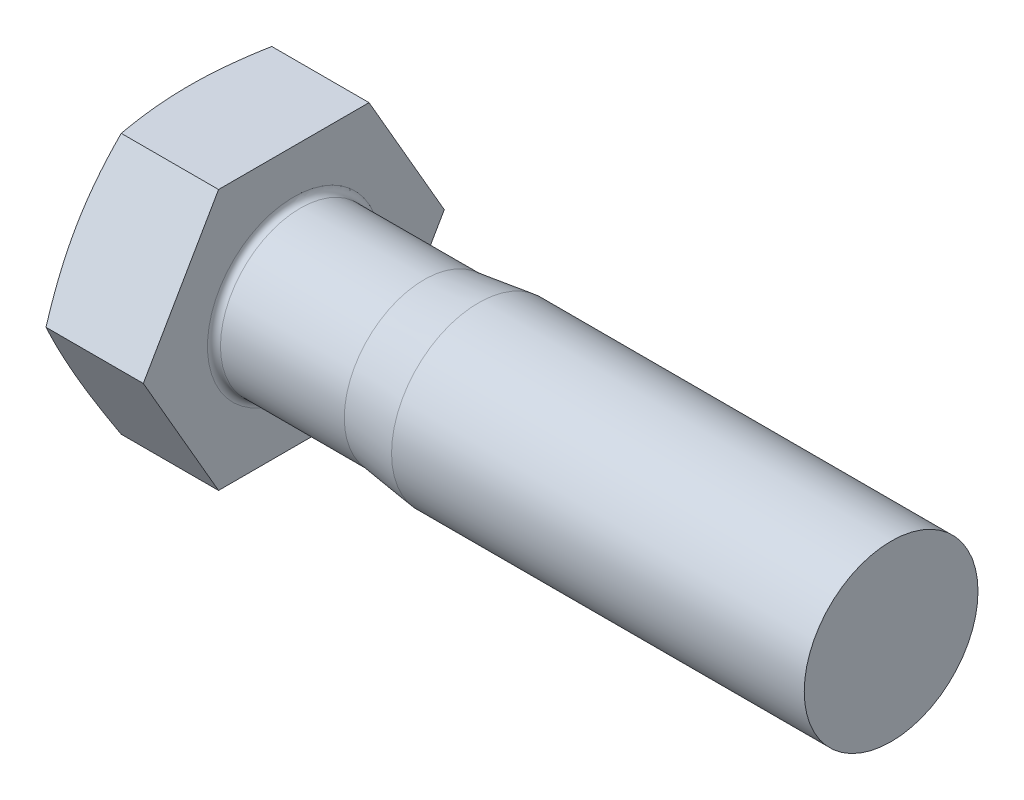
ISO-10303-21;
HEADER;
FILE_DESCRIPTION(('STEP AP214'),'2;1');
FILE_NAME('part.step','',(''),(''),'','','');
FILE_SCHEMA(('AUTOMOTIVE_DESIGN { 1 0 10303 214 1 1 1 1 }'));
ENDSEC;
DATA;
#1=APPLICATION_CONTEXT('core data for automotive mechanical design processes');
#2=APPLICATION_PROTOCOL_DEFINITION('international standard','automotive_design',2000,#1);
#3=PRODUCT_CONTEXT('',#1,'mechanical');
#4=PRODUCT('Part','Part','',(#3));
#5=PRODUCT_RELATED_PRODUCT_CATEGORY('part','',(#4));
#6=PRODUCT_DEFINITION_FORMATION('','',#4);
#7=PRODUCT_DEFINITION_CONTEXT('part definition',#1,'design');
#8=PRODUCT_DEFINITION('design','',#6,#7);
#9=PRODUCT_DEFINITION_SHAPE('','',#8);
#10=(LENGTH_UNIT() NAMED_UNIT(*) SI_UNIT(.MILLI.,.METRE.));
#11=(NAMED_UNIT(*) PLANE_ANGLE_UNIT() SI_UNIT($,.RADIAN.));
#12=(NAMED_UNIT(*) SI_UNIT($,.STERADIAN.) SOLID_ANGLE_UNIT());
#13=UNCERTAINTY_MEASURE_WITH_UNIT(LENGTH_MEASURE(1.E-05),#10,'distance_accuracy_value','');
#14=(GEOMETRIC_REPRESENTATION_CONTEXT(3) GLOBAL_UNCERTAINTY_ASSIGNED_CONTEXT((#13)) GLOBAL_UNIT_ASSIGNED_CONTEXT((#10,
#11,#12)) REPRESENTATION_CONTEXT('',''));
#15=CARTESIAN_POINT('',(0.,0.,0.));
#16=DIRECTION('',(0.,0.,1.));
#17=DIRECTION('',(1.,0.,0.));
#18=AXIS2_PLACEMENT_3D('',#15,#16,#17);
#19=CARTESIAN_POINT('',(10.,-12.,-6.92820323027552));
#20=DIRECTION('',(0.,0.5,0.866025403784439));
#21=DIRECTION('',(0.,-0.866025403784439,0.5));
#22=AXIS2_PLACEMENT_3D('',#19,#20,#21);
#23=PLANE('',#22);
#24=CARTESIAN_POINT('',(1.03968895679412,0.000200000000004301,-13.8565219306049));
#25=CARTESIAN_POINT('',(0.935221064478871,-0.496762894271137,-13.5696002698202));
#26=CARTESIAN_POINT('',(0.840189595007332,-0.995364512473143,-13.2817324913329));
#27=CARTESIAN_POINT('',(0.672996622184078,-1.99580957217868,-12.7041252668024));
#28=CARTESIAN_POINT('',(0.600853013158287,-2.49765523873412,-12.414384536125));
#29=CARTESIAN_POINT('',(0.484162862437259,-3.49901930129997,-11.8362467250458));
#30=CARTESIAN_POINT('',(0.439361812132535,-3.99851483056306,-11.5478628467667));
#31=CARTESIAN_POINT('',(0.379271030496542,-4.99867391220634,-10.9704207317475));
#32=CARTESIAN_POINT('',(0.3639702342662,-5.49933695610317,-10.6813627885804));
#33=CARTESIAN_POINT('',(0.363970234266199,-6.50066304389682,-10.1032469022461));
#34=CARTESIAN_POINT('',(0.379271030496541,-7.00132608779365,-9.81418895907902));
#35=CARTESIAN_POINT('',(0.439361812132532,-8.00148516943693,-9.23674684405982));
#36=CARTESIAN_POINT('',(0.484162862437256,-8.50098069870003,-8.94836296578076));
#37=CARTESIAN_POINT('',(0.600853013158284,-9.50234476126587,-8.37022515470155));
#38=CARTESIAN_POINT('',(0.672996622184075,-10.0041904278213,-8.08048442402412));
#39=CARTESIAN_POINT('',(0.840189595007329,-11.0046354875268,-7.5028771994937));
#40=CARTESIAN_POINT('',(0.935221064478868,-11.5032371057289,-7.21500942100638));
#41=CARTESIAN_POINT('',(1.03968895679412,-12.0002,-6.92808776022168));
#42=B_SPLINE_CURVE_WITH_KNOTS('',3,(#24,#25,#26,#27,#28,#29,#30,#31,#32,#33,#34,#35,#36,#37,#38,
#39,#40,#41),.UNSPECIFIED.,.F.,.F.,(4,2,2,2,2,2,2,2,4),(0.,1.75000540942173,3.50137566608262,
5.23618486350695,6.97034324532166,8.70450162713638,10.4393108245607,12.1906810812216,
13.9406864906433),.UNSPECIFIED.);
#43=CARTESIAN_POINT('',(1.03964692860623,0.,-13.856406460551));
#44=VERTEX_POINT('',#43);
#45=CARTESIAN_POINT('',(1.03964692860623,-12.,-6.92820323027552));
#46=VERTEX_POINT('',#45);
#47=EDGE_CURVE('E47',#44,#46,#42,.T.);
#48=ORIENTED_EDGE('',*,*,#47,.F.);
#49=DIRECTION('',(-1.,0.,0.));
#50=VECTOR('',#49,1.);
#51=CARTESIAN_POINT('',(10.,0.,-13.856406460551));
#52=LINE('',#51,#50);
#53=CARTESIAN_POINT('',(10.,0.,-13.856406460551));
#54=VERTEX_POINT('',#53);
#55=EDGE_CURVE('E118',#54,#44,#52,.T.);
#56=ORIENTED_EDGE('',*,*,#55,.F.);
#57=DIRECTION('',(0.,0.866025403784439,-0.5));
#58=VECTOR('',#57,1.);
#59=CARTESIAN_POINT('',(10.,-12.,-6.92820323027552));
#60=LINE('',#59,#58);
#61=CARTESIAN_POINT('',(10.,-12.,-6.92820323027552));
#62=VERTEX_POINT('',#61);
#63=EDGE_CURVE('E157',#62,#54,#60,.T.);
#64=ORIENTED_EDGE('',*,*,#63,.F.);
#65=DIRECTION('',(-1.,0.,0.));
#66=VECTOR('',#65,1.);
#67=CARTESIAN_POINT('',(10.,-12.,-6.92820323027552));
#68=LINE('',#67,#66);
#69=EDGE_CURVE('E112',#62,#46,#68,.T.);
#70=ORIENTED_EDGE('',*,*,#69,.T.);
#71=EDGE_LOOP('',(#48,#56,#64,#70));
#72=FACE_BOUND('',#71,.T.);
#73=ADVANCED_FACE('F32',(#72),#23,.F.);
#74=CARTESIAN_POINT('',(10.,0.,-13.856406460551));
#75=DIRECTION('',(0.,-0.5,0.866025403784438));
#76=DIRECTION('',(0.,-0.866025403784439,-0.5));
#77=AXIS2_PLACEMENT_3D('',#74,#75,#76);
#78=PLANE('',#77);
#79=CARTESIAN_POINT('',(1.03968895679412,12.0002,-6.92808776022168));
#80=CARTESIAN_POINT('',(0.935221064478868,11.5032371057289,-7.21500942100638));
#81=CARTESIAN_POINT('',(0.840189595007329,11.0046354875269,-7.50287719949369));
#82=CARTESIAN_POINT('',(0.672996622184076,10.0041904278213,-8.08048442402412));
#83=CARTESIAN_POINT('',(0.600853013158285,9.50234476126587,-8.37022515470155));
#84=CARTESIAN_POINT('',(0.484162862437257,8.50098069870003,-8.94836296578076));
#85=CARTESIAN_POINT('',(0.439361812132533,8.00148516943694,-9.23674684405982));
#86=CARTESIAN_POINT('',(0.379271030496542,7.00132608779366,-9.81418895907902));
#87=CARTESIAN_POINT('',(0.3639702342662,6.50066304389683,-10.1032469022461));
#88=CARTESIAN_POINT('',(0.363970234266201,5.49933695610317,-10.6813627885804));
#89=CARTESIAN_POINT('',(0.379271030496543,4.99867391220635,-10.9704207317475));
#90=CARTESIAN_POINT('',(0.439361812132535,3.99851483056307,-11.5478628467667));
#91=CARTESIAN_POINT('',(0.484162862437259,3.49901930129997,-11.8362467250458));
#92=CARTESIAN_POINT('',(0.600853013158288,2.49765523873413,-12.414384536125));
#93=CARTESIAN_POINT('',(0.672996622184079,1.99580957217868,-12.7041252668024));
#94=CARTESIAN_POINT('',(0.840189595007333,0.995364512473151,-13.2817324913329));
#95=CARTESIAN_POINT('',(0.935221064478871,0.496762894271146,-13.5696002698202));
#96=CARTESIAN_POINT('',(1.03968895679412,-0.000199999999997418,-13.8565219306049));
#97=B_SPLINE_CURVE_WITH_KNOTS('',3,(#79,#80,#81,#82,#83,#84,#85,#86,#87,#88,#89,#90,#91,#92,#93,
#94,#95,#96),.UNSPECIFIED.,.F.,.F.,(4,2,2,2,2,2,2,2,4),(0.,1.75000540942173,3.50137566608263,
5.23618486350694,6.97034324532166,8.70450162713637,10.4393108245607,12.1906810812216,
13.9406864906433),.UNSPECIFIED.);
#98=CARTESIAN_POINT('',(1.03964692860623,12.,-6.92820323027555));
#99=VERTEX_POINT('',#98);
#100=EDGE_CURVE('E150',#99,#44,#97,.T.);
#101=ORIENTED_EDGE('',*,*,#100,.F.);
#102=DIRECTION('',(-1.,0.,0.));
#103=VECTOR('',#102,1.);
#104=CARTESIAN_POINT('',(10.,12.,-6.92820323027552));
#105=LINE('',#104,#103);
#106=CARTESIAN_POINT('',(10.,12.,-6.92820323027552));
#107=VERTEX_POINT('',#106);
#108=EDGE_CURVE('E110',#107,#99,#105,.T.);
#109=ORIENTED_EDGE('',*,*,#108,.F.);
#110=DIRECTION('',(0.,0.866025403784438,0.5));
#111=VECTOR('',#110,1.);
#112=CARTESIAN_POINT('',(10.,0.,-13.856406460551));
#113=LINE('',#112,#111);
#114=EDGE_CURVE('E154',#54,#107,#113,.T.);
#115=ORIENTED_EDGE('',*,*,#114,.F.);
#116=ORIENTED_EDGE('',*,*,#55,.T.);
#117=EDGE_LOOP('',(#101,#109,#115,#116));
#118=FACE_BOUND('',#117,.T.);
#119=ADVANCED_FACE('F139',(#118),#78,.F.);
#120=CARTESIAN_POINT('',(10.,12.,-6.92820323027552));
#121=DIRECTION('',(0.,-1.,0.));
#122=DIRECTION('',(0.,0.,-1.));
#123=AXIS2_PLACEMENT_3D('',#120,#121,#122);
#124=PLANE('',#123);
#125=CARTESIAN_POINT('',(3.96396734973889,12.,-18.3087950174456));
#126=CARTESIAN_POINT('',(3.79884886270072,12.,-17.7662249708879));
#127=CARTESIAN_POINT('',(3.63566479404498,12.,-17.2230552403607));
#128=CARTESIAN_POINT('',(3.31423573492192,12.,-16.1352111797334));
#129=CARTESIAN_POINT('',(3.15599113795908,12.,-15.5905367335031));
#130=CARTESIAN_POINT('',(2.84524590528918,12.,-14.4984381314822));
#131=CARTESIAN_POINT('',(2.69275663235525,12.,-13.9510107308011));
#132=CARTESIAN_POINT('',(2.3953163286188,12.,-12.8541146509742));
#133=CARTESIAN_POINT('',(2.25036516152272,12.,-12.304646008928));
#134=CARTESIAN_POINT('',(1.97161365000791,12.,-11.2101580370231));
#135=CARTESIAN_POINT('',(1.83769693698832,12.,-10.6651684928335));
#136=CARTESIAN_POINT('',(1.58131725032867,12.,-9.5724735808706));
#137=CARTESIAN_POINT('',(1.45885446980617,12.,-9.02476816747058));
#138=CARTESIAN_POINT('',(1.22824895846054,12.,-7.92652528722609));
#139=CARTESIAN_POINT('',(1.12010122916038,12.,-7.37598887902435));
#140=CARTESIAN_POINT('',(0.921428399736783,12.,-6.27172169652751));
#141=CARTESIAN_POINT('',(0.830902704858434,12.,-5.71799103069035));
#142=CARTESIAN_POINT('',(0.680125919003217,12.,-4.66974970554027));
#143=CARTESIAN_POINT('',(0.617617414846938,12.,-4.17556679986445));
#144=CARTESIAN_POINT('',(0.511920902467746,12.,-3.18512193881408));
#145=CARTESIAN_POINT('',(0.468732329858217,12.,-2.68886004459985));
#146=CARTESIAN_POINT('',(0.403756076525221,12.,-1.6952644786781));
#147=CARTESIAN_POINT('',(0.381953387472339,12.,-1.197931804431));
#148=CARTESIAN_POINT('',(0.360851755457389,12.,-0.202784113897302));
#149=CARTESIAN_POINT('',(0.361552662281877,12.,0.295030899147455));
#150=CARTESIAN_POINT('',(0.385481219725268,12.,1.29266481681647));
#151=CARTESIAN_POINT('',(0.408824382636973,12.,1.79248090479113));
#152=CARTESIAN_POINT('',(0.47696449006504,12.,2.79063583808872));
#153=CARTESIAN_POINT('',(0.521761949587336,12.,3.28897464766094));
#154=CARTESIAN_POINT('',(0.630722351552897,12.,4.28393280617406));
#155=CARTESIAN_POINT('',(0.694901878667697,12.,4.78055031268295));
#156=CARTESIAN_POINT('',(0.840033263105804,12.,5.77130057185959));
#157=CARTESIAN_POINT('',(0.92098520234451,12.,6.26543331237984));
#158=CARTESIAN_POINT('',(1.10220294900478,12.,7.28006763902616));
#159=CARTESIAN_POINT('',(1.2033232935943,12.,7.80041525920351));
#160=CARTESIAN_POINT('',(1.41857818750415,12.,8.83842892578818));
#161=CARTESIAN_POINT('',(1.53271372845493,12.,9.35609476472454));
#162=CARTESIAN_POINT('',(1.77159173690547,12.,10.3891186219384));
#163=CARTESIAN_POINT('',(1.89633731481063,12.,10.904475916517));
#164=CARTESIAN_POINT('',(2.15439952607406,12.,11.9330162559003));
#165=CARTESIAN_POINT('',(2.28771595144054,12.,12.4461993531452));
#166=CARTESIAN_POINT('',(2.56148831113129,12.,13.4713608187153));
#167=CARTESIAN_POINT('',(2.70195324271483,12.,13.9833367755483));
#168=CARTESIAN_POINT('',(2.98857841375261,12.,15.0056897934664));
#169=CARTESIAN_POINT('',(3.1347386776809,12.,15.5160668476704));
#170=CARTESIAN_POINT('',(3.4317064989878,12.,16.5353680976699));
#171=CARTESIAN_POINT('',(3.58251324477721,12.,17.0442925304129));
#172=CARTESIAN_POINT('',(3.88799531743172,12.,18.0609803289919));
#173=CARTESIAN_POINT('',(4.04267066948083,12.,18.568743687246));
#174=CARTESIAN_POINT('',(4.5079543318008,12.,20.0790517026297));
#175=CARTESIAN_POINT('',(4.82321954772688,12.,21.0801614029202));
#176=CARTESIAN_POINT('',(5.46263375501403,12.,23.0795787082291));
#177=CARTESIAN_POINT('',(5.78678317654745,12.,24.0778861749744));
#178=CARTESIAN_POINT('',(6.44034806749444,12.,26.0685686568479));
#179=CARTESIAN_POINT('',(6.76973882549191,12.,27.0609517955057));
#180=CARTESIAN_POINT('',(7.26745556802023,12.,28.5482638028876));
#181=CARTESIAN_POINT('',(7.43395945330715,12.,29.0438040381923));
#182=CARTESIAN_POINT('',(7.76803768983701,12.,30.0345222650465));
#183=CARTESIAN_POINT('',(7.93561203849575,12.,30.5297002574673));
#184=CARTESIAN_POINT('',(8.10365001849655,12.,31.02472094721));
#185=B_SPLINE_CURVE_WITH_KNOTS('',3,(#125,#126,#127,#128,#129,#130,#131,#132,#133,#134,#135,
#136,#137,#138,#139,#140,#141,#142,#143,#144,#145,#146,#147,#148,#149,#150,#151,#152,#153,#154,
#155,#156,#157,#158,#159,#160,#161,#162,#163,#164,#165,#166,#167,#168,#169,#170,#171,#172,#173,
#174,#175,#176,#177,#178,#179,#180,#181,#182,#183,#184),.UNSPECIFIED.,.F.,.F.,(4,2,2,2,2,2,2,2,
2,2,2,2,2,2,2,2,2,2,2,2,2,2,2,2,2,2,2,2,2,4),(0.,1.70142841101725,3.40299202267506,
5.10775586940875,6.81248888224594,8.49599601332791,10.1795315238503,11.8624776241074,
13.5453669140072,15.0393995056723,16.5333884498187,18.0263281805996,19.5192579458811,
21.019844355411,22.5204667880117,24.0223769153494,25.524294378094,27.1143358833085,
28.7044986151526,30.2951291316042,31.8857210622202,33.4783669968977,35.0710197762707,
36.6633959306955,38.2557824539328,41.4044472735,44.5532648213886,47.6901088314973,
49.2584041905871,50.8266957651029),.UNSPECIFIED.);
#186=CARTESIAN_POINT('',(1.03964692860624,12.0000000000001,6.92820323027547));
#187=VERTEX_POINT('',#186);
#188=EDGE_CURVE('E104',#187,#99,#185,.F.);
#189=ORIENTED_EDGE('',*,*,#188,.F.);
#190=DIRECTION('',(-1.,0.,0.));
#191=VECTOR('',#190,1.);
#192=CARTESIAN_POINT('',(10.,12.,6.9282032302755));
#193=LINE('',#192,#191);
#194=CARTESIAN_POINT('',(10.,12.,6.9282032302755));
#195=VERTEX_POINT('',#194);
#196=EDGE_CURVE('E103',#195,#187,#193,.T.);
#197=ORIENTED_EDGE('',*,*,#196,.F.);
#198=DIRECTION('',(0.,0.,1.));
#199=VECTOR('',#198,1.);
#200=CARTESIAN_POINT('',(10.,12.,-6.92820323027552));
#201=LINE('',#200,#199);
#202=EDGE_CURVE('E156',#107,#195,#201,.T.);
#203=ORIENTED_EDGE('',*,*,#202,.F.);
#204=ORIENTED_EDGE('',*,*,#108,.T.);
#205=EDGE_LOOP('',(#189,#197,#203,#204));
#206=FACE_BOUND('',#205,.T.);
#207=ADVANCED_FACE('F144',(#206),#124,.F.);
#208=CARTESIAN_POINT('',(10.,12.,6.9282032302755));
#209=DIRECTION('',(0.,-0.5,-0.866025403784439));
#210=DIRECTION('',(0.,0.866025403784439,-0.5));
#211=AXIS2_PLACEMENT_3D('',#208,#209,#210);
#212=PLANE('',#211);
#213=CARTESIAN_POINT('',(1.03968895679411,-0.000199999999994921,13.8565219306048));
#214=CARTESIAN_POINT('',(0.93522106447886,0.496762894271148,13.5696002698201));
#215=CARTESIAN_POINT('',(0.840189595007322,0.995364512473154,13.2817324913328));
#216=CARTESIAN_POINT('',(0.672996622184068,1.99580957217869,12.7041252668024));
#217=CARTESIAN_POINT('',(0.600853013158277,2.49765523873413,12.414384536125));
#218=CARTESIAN_POINT('',(0.484162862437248,3.49901930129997,11.8362467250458));
#219=CARTESIAN_POINT('',(0.439361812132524,3.99851483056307,11.5478628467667));
#220=CARTESIAN_POINT('',(0.379271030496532,4.99867391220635,10.9704207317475));
#221=CARTESIAN_POINT('',(0.36397023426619,5.49933695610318,10.6813627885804));
#222=CARTESIAN_POINT('',(0.363970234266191,6.50066304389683,10.1032469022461));
#223=CARTESIAN_POINT('',(0.379271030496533,7.00132608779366,9.81418895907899));
#224=CARTESIAN_POINT('',(0.439361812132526,8.00148516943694,9.23674684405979));
#225=CARTESIAN_POINT('',(0.48416286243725,8.50098069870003,8.94836296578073));
#226=CARTESIAN_POINT('',(0.600853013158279,9.50234476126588,8.37022515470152));
#227=CARTESIAN_POINT('',(0.67299662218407,10.0041904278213,8.08048442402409));
#228=CARTESIAN_POINT('',(0.840189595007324,11.0046354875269,7.50287719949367));
#229=CARTESIAN_POINT('',(0.935221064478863,11.5032371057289,7.21500942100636));
#230=CARTESIAN_POINT('',(1.03968895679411,12.0002,6.92808776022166));
#231=B_SPLINE_CURVE_WITH_KNOTS('',3,(#213,#214,#215,#216,#217,#218,#219,#220,#221,#222,#223,
#224,#225,#226,#227,#228,#229,#230),.UNSPECIFIED.,.F.,.F.,(4,2,2,2,2,2,2,2,4),(0.,
1.75000540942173,3.50137566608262,5.23618486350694,6.97034324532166,8.70450162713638,
10.4393108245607,12.1906810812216,13.9406864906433),.UNSPECIFIED.);
#232=CARTESIAN_POINT('',(1.03964692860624,0.,13.856406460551));
#233=VERTEX_POINT('',#232);
#234=EDGE_CURVE('E87',#233,#187,#231,.T.);
#235=ORIENTED_EDGE('',*,*,#234,.F.);
#236=DIRECTION('',(-1.,0.,0.));
#237=VECTOR('',#236,1.);
#238=CARTESIAN_POINT('',(10.,0.,13.856406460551));
#239=LINE('',#238,#237);
#240=CARTESIAN_POINT('',(10.,0.,13.856406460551));
#241=VERTEX_POINT('',#240);
#242=EDGE_CURVE('E100',#241,#233,#239,.T.);
#243=ORIENTED_EDGE('',*,*,#242,.F.);
#244=DIRECTION('',(0.,-0.866025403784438,0.5));
#245=VECTOR('',#244,1.);
#246=CARTESIAN_POINT('',(10.,12.,6.9282032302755));
#247=LINE('',#246,#245);
#248=EDGE_CURVE('E164',#195,#241,#247,.T.);
#249=ORIENTED_EDGE('',*,*,#248,.F.);
#250=ORIENTED_EDGE('',*,*,#196,.T.);
#251=EDGE_LOOP('',(#235,#243,#249,#250));
#252=FACE_BOUND('',#251,.T.);
#253=ADVANCED_FACE('F98',(#252),#212,.F.);
#254=CARTESIAN_POINT('',(10.,0.,13.856406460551));
#255=DIRECTION('',(0.,0.5,-0.866025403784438));
#256=DIRECTION('',(0.,0.866025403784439,0.5));
#257=AXIS2_PLACEMENT_3D('',#254,#255,#256);
#258=PLANE('',#257);
#259=CARTESIAN_POINT('',(1.03968895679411,-12.0002,6.92808776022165));
#260=CARTESIAN_POINT('',(0.935221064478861,-11.5032371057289,7.21500942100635));
#261=CARTESIAN_POINT('',(0.840189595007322,-11.0046354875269,7.50287719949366));
#262=CARTESIAN_POINT('',(0.672996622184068,-10.0041904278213,8.08048442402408));
#263=CARTESIAN_POINT('',(0.600853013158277,-9.50234476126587,8.37022515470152));
#264=CARTESIAN_POINT('',(0.484162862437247,-8.50098069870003,8.94836296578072));
#265=CARTESIAN_POINT('',(0.439361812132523,-8.00148516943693,9.23674684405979));
#266=CARTESIAN_POINT('',(0.379271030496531,-7.00132608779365,9.81418895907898));
#267=CARTESIAN_POINT('',(0.363970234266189,-6.50066304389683,10.1032469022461));
#268=CARTESIAN_POINT('',(0.363970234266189,-5.49933695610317,10.6813627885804));
#269=CARTESIAN_POINT('',(0.379271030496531,-4.99867391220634,10.9704207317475));
#270=CARTESIAN_POINT('',(0.439361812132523,-3.99851483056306,11.5478628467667));
#271=CARTESIAN_POINT('',(0.484162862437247,-3.49901930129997,11.8362467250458));
#272=CARTESIAN_POINT('',(0.600853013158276,-2.49765523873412,12.414384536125));
#273=CARTESIAN_POINT('',(0.672996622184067,-1.99580957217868,12.7041252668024));
#274=CARTESIAN_POINT('',(0.840189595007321,-0.995364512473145,13.2817324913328));
#275=CARTESIAN_POINT('',(0.93522106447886,-0.496762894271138,13.5696002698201));
#276=CARTESIAN_POINT('',(1.03968895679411,0.000200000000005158,13.8565219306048));
#277=B_SPLINE_CURVE_WITH_KNOTS('',3,(#259,#260,#261,#262,#263,#264,#265,#266,#267,#268,#269,
#270,#271,#272,#273,#274,#275,#276),.UNSPECIFIED.,.F.,.F.,(4,2,2,2,2,2,2,2,4),(0.,
1.75000540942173,3.50137566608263,5.23618486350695,6.97034324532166,8.70450162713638,
10.4393108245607,12.1906810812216,13.9406864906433),.UNSPECIFIED.);
#278=CARTESIAN_POINT('',(1.03964692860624,-12.,6.92820323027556));
#279=VERTEX_POINT('',#278);
#280=EDGE_CURVE('E84',#279,#233,#277,.T.);
#281=ORIENTED_EDGE('',*,*,#280,.F.);
#282=DIRECTION('',(-1.,0.,0.));
#283=VECTOR('',#282,1.);
#284=CARTESIAN_POINT('',(10.,-12.,6.92820323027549));
#285=LINE('',#284,#283);
#286=CARTESIAN_POINT('',(10.,-12.,6.92820323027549));
#287=VERTEX_POINT('',#286);
#288=EDGE_CURVE('E108',#287,#279,#285,.T.);
#289=ORIENTED_EDGE('',*,*,#288,.F.);
#290=DIRECTION('',(0.,-0.866025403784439,-0.5));
#291=VECTOR('',#290,1.);
#292=CARTESIAN_POINT('',(10.,0.,13.856406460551));
#293=LINE('',#292,#291);
#294=EDGE_CURVE('E107',#241,#287,#293,.T.);
#295=ORIENTED_EDGE('',*,*,#294,.F.);
#296=ORIENTED_EDGE('',*,*,#242,.T.);
#297=EDGE_LOOP('',(#281,#289,#295,#296));
#298=FACE_BOUND('',#297,.T.);
#299=ADVANCED_FACE('F106',(#298),#258,.F.);
#300=CARTESIAN_POINT('',(10.,-12.,6.92820323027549));
#301=DIRECTION('',(0.,1.,0.));
#302=DIRECTION('',(0.,0.,1.));
#303=AXIS2_PLACEMENT_3D('',#300,#301,#302);
#304=PLANE('',#303);
#305=CARTESIAN_POINT('',(3.96396734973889,-12.,-18.3087950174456));
#306=CARTESIAN_POINT('',(3.79884886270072,-12.,-17.7662249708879));
#307=CARTESIAN_POINT('',(3.63566479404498,-12.,-17.2230552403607));
#308=CARTESIAN_POINT('',(3.31423573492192,-12.,-16.1352111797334));
#309=CARTESIAN_POINT('',(3.15599113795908,-12.,-15.5905367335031));
#310=CARTESIAN_POINT('',(2.84524590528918,-12.,-14.4984381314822));
#311=CARTESIAN_POINT('',(2.69275663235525,-12.,-13.9510107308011));
#312=CARTESIAN_POINT('',(2.3953163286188,-12.,-12.8541146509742));
#313=CARTESIAN_POINT('',(2.25036516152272,-12.,-12.304646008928));
#314=CARTESIAN_POINT('',(1.97161365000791,-12.,-11.2101580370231));
#315=CARTESIAN_POINT('',(1.83769693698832,-12.,-10.6651684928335));
#316=CARTESIAN_POINT('',(1.58131725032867,-12.,-9.5724735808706));
#317=CARTESIAN_POINT('',(1.45885446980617,-12.,-9.02476816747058));
#318=CARTESIAN_POINT('',(1.22824895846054,-12.,-7.92652528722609));
#319=CARTESIAN_POINT('',(1.12010122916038,-12.,-7.37598887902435));
#320=CARTESIAN_POINT('',(0.921428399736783,-12.,-6.27172169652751));
#321=CARTESIAN_POINT('',(0.830902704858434,-12.,-5.71799103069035));
#322=CARTESIAN_POINT('',(0.680125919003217,-12.,-4.66974970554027));
#323=CARTESIAN_POINT('',(0.617617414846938,-12.,-4.17556679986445));
#324=CARTESIAN_POINT('',(0.511920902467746,-12.,-3.18512193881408));
#325=CARTESIAN_POINT('',(0.468732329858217,-12.,-2.68886004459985));
#326=CARTESIAN_POINT('',(0.403756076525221,-12.,-1.6952644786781));
#327=CARTESIAN_POINT('',(0.381953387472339,-12.,-1.197931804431));
#328=CARTESIAN_POINT('',(0.360851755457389,-12.,-0.202784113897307));
#329=CARTESIAN_POINT('',(0.361552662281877,-12.,0.29503089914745));
#330=CARTESIAN_POINT('',(0.385481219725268,-12.,1.29266481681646));
#331=CARTESIAN_POINT('',(0.408824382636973,-12.,1.79248090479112));
#332=CARTESIAN_POINT('',(0.476964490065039,-12.,2.79063583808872));
#333=CARTESIAN_POINT('',(0.521761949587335,-12.,3.28897464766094));
#334=CARTESIAN_POINT('',(0.630722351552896,-12.,4.28393280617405));
#335=CARTESIAN_POINT('',(0.694901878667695,-12.,4.78055031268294));
#336=CARTESIAN_POINT('',(0.840033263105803,-12.,5.77130057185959));
#337=CARTESIAN_POINT('',(0.92098520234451,-12.,6.26543331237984));
#338=CARTESIAN_POINT('',(1.10220294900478,-12.,7.28006763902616));
#339=CARTESIAN_POINT('',(1.2033232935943,-12.,7.8004152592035));
#340=CARTESIAN_POINT('',(1.41857818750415,-12.,8.83842892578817));
#341=CARTESIAN_POINT('',(1.53271372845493,-12.,9.35609476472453));
#342=CARTESIAN_POINT('',(1.77159173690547,-12.,10.3891186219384));
#343=CARTESIAN_POINT('',(1.89633731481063,-12.,10.904475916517));
#344=CARTESIAN_POINT('',(2.15439952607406,-12.,11.9330162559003));
#345=CARTESIAN_POINT('',(2.28771595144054,-12.,12.4461993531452));
#346=CARTESIAN_POINT('',(2.56148831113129,-12.,13.4713608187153));
#347=CARTESIAN_POINT('',(2.70195324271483,-12.,13.9833367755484));
#348=CARTESIAN_POINT('',(2.98857841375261,-12.,15.0056897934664));
#349=CARTESIAN_POINT('',(3.13473867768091,-12.,15.5160668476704));
#350=CARTESIAN_POINT('',(3.43170649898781,-12.,16.5353680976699));
#351=CARTESIAN_POINT('',(3.58251324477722,-12.,17.0442925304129));
#352=CARTESIAN_POINT('',(3.88799531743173,-12.,18.0609803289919));
#353=CARTESIAN_POINT('',(4.04267066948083,-12.,18.568743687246));
#354=CARTESIAN_POINT('',(4.50795433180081,-12.,20.0790517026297));
#355=CARTESIAN_POINT('',(4.82321954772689,-12.,21.0801614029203));
#356=CARTESIAN_POINT('',(5.46263375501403,-12.,23.0795787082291));
#357=CARTESIAN_POINT('',(5.78678317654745,-12.,24.0778861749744));
#358=CARTESIAN_POINT('',(6.44034806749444,-12.,26.0685686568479));
#359=CARTESIAN_POINT('',(6.76973882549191,-12.,27.0609517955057));
#360=CARTESIAN_POINT('',(7.26745556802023,-12.,28.5482638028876));
#361=CARTESIAN_POINT('',(7.43395945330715,-12.,29.0438040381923));
#362=CARTESIAN_POINT('',(7.768037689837,-12.,30.0345222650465));
#363=CARTESIAN_POINT('',(7.93561203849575,-12.,30.5297002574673));
#364=CARTESIAN_POINT('',(8.10365001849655,-12.,31.02472094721));
#365=B_SPLINE_CURVE_WITH_KNOTS('',3,(#305,#306,#307,#308,#309,#310,#311,#312,#313,#314,#315,
#316,#317,#318,#319,#320,#321,#322,#323,#324,#325,#326,#327,#328,#329,#330,#331,#332,#333,#334,
#335,#336,#337,#338,#339,#340,#341,#342,#343,#344,#345,#346,#347,#348,#349,#350,#351,#352,#353,
#354,#355,#356,#357,#358,#359,#360,#361,#362,#363,#364),.UNSPECIFIED.,.F.,.F.,(4,2,2,2,2,2,2,2,
2,2,2,2,2,2,2,2,2,2,2,2,2,2,2,2,2,2,2,2,2,4),(0.,1.70142841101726,3.40299202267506,
5.10775586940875,6.81248888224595,8.49599601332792,10.1795315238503,11.8624776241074,
13.5453669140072,15.0393995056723,16.5333884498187,18.0263281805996,19.5192579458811,
21.019844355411,22.5204667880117,24.0223769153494,25.524294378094,27.1143358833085,
28.7044986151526,30.2951291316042,31.8857210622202,33.4783669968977,35.0710197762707,
36.6633959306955,38.2557824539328,41.4044472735,44.5532648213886,47.6901088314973,
49.2584041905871,50.8266957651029),.UNSPECIFIED.);
#366=EDGE_CURVE('E89',#46,#279,#365,.T.);
#367=ORIENTED_EDGE('',*,*,#366,.F.);
#368=ORIENTED_EDGE('',*,*,#69,.F.);
#369=DIRECTION('',(0.,0.,-1.));
#370=VECTOR('',#369,1.);
#371=CARTESIAN_POINT('',(10.,-12.,6.92820323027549));
#372=LINE('',#371,#370);
#373=EDGE_CURVE('E55',#287,#62,#372,.T.);
#374=ORIENTED_EDGE('',*,*,#373,.F.);
#375=ORIENTED_EDGE('',*,*,#288,.T.);
#376=EDGE_LOOP('',(#367,#368,#374,#375));
#377=FACE_BOUND('',#376,.T.);
#378=ADVANCED_FACE('F168',(#377),#304,.F.);
#379=CARTESIAN_POINT('',(10.,0.,-13.856406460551));
#380=DIRECTION('',(1.,0.,0.));
#381=DIRECTION('',(0.,0.,-1.));
#382=AXIS2_PLACEMENT_3D('',#379,#380,#381);
#383=PLANE('',#382);
#384=CARTESIAN_POINT('',(10.,0.,0.));
#385=DIRECTION('',(1.,0.,0.));
#386=DIRECTION('',(0.,0.,-1.));
#387=AXIS2_PLACEMENT_3D('',#384,#385,#386);
#388=CIRCLE('',#387,7.9505);
#389=CARTESIAN_POINT('',(10.,0.,-7.9505));
#390=VERTEX_POINT('',#389);
#391=EDGE_CURVE('E40',#390,#390,#388,.F.);
#392=ORIENTED_EDGE('',*,*,#391,.T.);
#393=EDGE_LOOP('',(#392));
#394=FACE_BOUND('',#393,.T.);
#395=ORIENTED_EDGE('',*,*,#63,.T.);
#396=ORIENTED_EDGE('',*,*,#114,.T.);
#397=ORIENTED_EDGE('',*,*,#202,.T.);
#398=ORIENTED_EDGE('',*,*,#248,.T.);
#399=ORIENTED_EDGE('',*,*,#294,.T.);
#400=ORIENTED_EDGE('',*,*,#373,.T.);
#401=EDGE_LOOP('',(#395,#396,#397,#398,#399,#400));
#402=FACE_BOUND('',#401,.T.);
#403=ADVANCED_FACE('F123',(#394,#402),#383,.T.);
#404=CARTESIAN_POINT('',(0.,0.,0.));
#405=DIRECTION('',(1.,0.,0.));
#406=DIRECTION('',(0.,0.,-1.));
#407=AXIS2_PLACEMENT_3D('',#404,#405,#406);
#408=CONICAL_SURFACE('',#407,11.,1.22173047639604);
#409=CARTESIAN_POINT('',(0.,0.,0.));
#410=DIRECTION('',(-1.,0.,0.));
#411=DIRECTION('',(0.,0.,1.));
#412=AXIS2_PLACEMENT_3D('',#409,#410,#411);
#413=CIRCLE('',#412,11.);
#414=CARTESIAN_POINT('',(0.,0.,11.));
#415=VERTEX_POINT('',#414);
#416=EDGE_CURVE('E169',#415,#415,#413,.T.);
#417=ORIENTED_EDGE('',*,*,#416,.F.);
#418=EDGE_LOOP('',(#417));
#419=FACE_BOUND('',#418,.T.);
#420=ORIENTED_EDGE('',*,*,#47,.T.);
#421=ORIENTED_EDGE('',*,*,#366,.T.);
#422=ORIENTED_EDGE('',*,*,#280,.T.);
#423=ORIENTED_EDGE('',*,*,#234,.T.);
#424=ORIENTED_EDGE('',*,*,#188,.T.);
#425=ORIENTED_EDGE('',*,*,#100,.T.);
#426=EDGE_LOOP('',(#420,#421,#422,#423,#424,#425));
#427=FACE_BOUND('',#426,.T.);
#428=ADVANCED_FACE('F86',(#419,#427),#408,.T.);
#429=CARTESIAN_POINT('',(0.,0.,-13.856406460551));
#430=DIRECTION('',(1.,0.,0.));
#431=DIRECTION('',(0.,0.,-1.));
#432=AXIS2_PLACEMENT_3D('',#429,#430,#431);
#433=PLANE('',#432);
#434=CARTESIAN_POINT('',(0.,0.,0.));
#435=DIRECTION('',(-1.,0.,0.));
#436=DIRECTION('',(0.,0.,1.));
#437=AXIS2_PLACEMENT_3D('',#434,#435,#436);
#438=CIRCLE('',#437,8.85);
#439=CARTESIAN_POINT('',(0.,0.,8.85));
#440=VERTEX_POINT('',#439);
#441=EDGE_CURVE('E242',#440,#440,#438,.T.);
#442=ORIENTED_EDGE('',*,*,#441,.F.);
#443=EDGE_LOOP('',(#442));
#444=FACE_BOUND('',#443,.T.);
#445=ORIENTED_EDGE('',*,*,#416,.T.);
#446=EDGE_LOOP('',(#445));
#447=FACE_BOUND('',#446,.T.);
#448=ADVANCED_FACE('F190',(#444,#447),#433,.F.);
#449=CARTESIAN_POINT('',(2.,0.,0.));
#450=DIRECTION('',(-1.,0.,0.));
#451=DIRECTION('',(0.,0.,1.));
#452=AXIS2_PLACEMENT_3D('',#449,#450,#451);
#453=CYLINDRICAL_SURFACE('',#452,8.85);
#454=CARTESIAN_POINT('',(2.,0.,0.));
#455=DIRECTION('',(-1.,0.,0.));
#456=DIRECTION('',(0.,0.,1.));
#457=AXIS2_PLACEMENT_3D('',#454,#455,#456);
#458=CIRCLE('',#457,8.85);
#459=CARTESIAN_POINT('',(2.,0.,8.85));
#460=VERTEX_POINT('',#459);
#461=EDGE_CURVE('E172',#460,#460,#458,.T.);
#462=ORIENTED_EDGE('',*,*,#461,.F.);
#463=EDGE_LOOP('',(#462));
#464=FACE_BOUND('',#463,.T.);
#465=ORIENTED_EDGE('',*,*,#441,.T.);
#466=EDGE_LOOP('',(#465));
#467=FACE_BOUND('',#466,.T.);
#468=ADVANCED_FACE('F192',(#464,#467),#453,.F.);
#469=CARTESIAN_POINT('',(2.,0.,0.));
#470=DIRECTION('',(-1.,0.,0.));
#471=DIRECTION('',(0.,0.,1.));
#472=AXIS2_PLACEMENT_3D('',#469,#470,#471);
#473=PLANE('',#472);
#474=ORIENTED_EDGE('',*,*,#461,.T.);
#475=EDGE_LOOP('',(#474));
#476=FACE_BOUND('',#475,.T.);
#477=ADVANCED_FACE('F237',(#476),#473,.T.);
#478=CARTESIAN_POINT('',(22.,0.,0.));
#479=DIRECTION('',(1.,0.,0.));
#480=DIRECTION('',(0.,0.,-1.));
#481=AXIS2_PLACEMENT_3D('',#478,#479,#480);
#482=CONICAL_SURFACE('',#481,7.3505,0.129176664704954);
#483=CARTESIAN_POINT('',(27.,0.,0.));
#484=DIRECTION('',(-1.,0.,0.));
#485=DIRECTION('',(0.,0.,1.));
#486=AXIS2_PLACEMENT_3D('',#483,#484,#485);
#487=CIRCLE('',#486,8.);
#488=CARTESIAN_POINT('',(27.,0.,7.99999999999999));
#489=VERTEX_POINT('',#488);
#490=EDGE_CURVE('E245',#489,#489,#487,.T.);
#491=ORIENTED_EDGE('',*,*,#490,.T.);
#492=EDGE_LOOP('',(#491));
#493=FACE_BOUND('',#492,.T.);
#494=CARTESIAN_POINT('',(22.,0.,0.));
#495=DIRECTION('',(-1.,0.,0.));
#496=DIRECTION('',(0.,0.,1.));
#497=AXIS2_PLACEMENT_3D('',#494,#495,#496);
#498=CIRCLE('',#497,7.3505);
#499=CARTESIAN_POINT('',(22.,0.,7.3505));
#500=VERTEX_POINT('',#499);
#501=EDGE_CURVE('E249',#500,#500,#498,.T.);
#502=ORIENTED_EDGE('',*,*,#501,.F.);
#503=EDGE_LOOP('',(#502));
#504=FACE_BOUND('',#503,.T.);
#505=ADVANCED_FACE('F257',(#493,#504),#482,.T.);
#506=CARTESIAN_POINT('',(-2.69717570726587,0.,0.));
#507=DIRECTION('',(-1.,0.,0.));
#508=DIRECTION('',(0.,0.,1.));
#509=AXIS2_PLACEMENT_3D('',#506,#507,#508);
#510=CYLINDRICAL_SURFACE('',#509,7.3505);
#511=CARTESIAN_POINT('',(10.6,0.,0.));
#512=DIRECTION('',(1.,0.,0.));
#513=DIRECTION('',(0.,0.,-1.));
#514=AXIS2_PLACEMENT_3D('',#511,#512,#513);
#515=CIRCLE('',#514,7.3505);
#516=CARTESIAN_POINT('',(10.6,0.,-7.3505));
#517=VERTEX_POINT('',#516);
#518=EDGE_CURVE('E11',#517,#517,#515,.T.);
#519=ORIENTED_EDGE('',*,*,#518,.T.);
#520=EDGE_LOOP('',(#519));
#521=FACE_BOUND('',#520,.T.);
#522=ORIENTED_EDGE('',*,*,#501,.T.);
#523=EDGE_LOOP('',(#522));
#524=FACE_BOUND('',#523,.T.);
#525=ADVANCED_FACE('F255',(#521,#524),#510,.T.);
#526=CARTESIAN_POINT('',(65.,0.,0.));
#527=DIRECTION('',(1.,0.,0.));
#528=DIRECTION('',(0.,0.,-1.));
#529=AXIS2_PLACEMENT_3D('',#526,#527,#528);
#530=PLANE('',#529);
#531=CARTESIAN_POINT('',(65.,0.,0.));
#532=DIRECTION('',(1.,0.,0.));
#533=DIRECTION('',(0.,0.,-1.));
#534=AXIS2_PLACEMENT_3D('',#531,#532,#533);
#535=CIRCLE('',#534,8.);
#536=CARTESIAN_POINT('',(65.,0.,-8.));
#537=VERTEX_POINT('',#536);
#538=EDGE_CURVE('E149',#537,#537,#535,.T.);
#539=ORIENTED_EDGE('',*,*,#538,.T.);
#540=EDGE_LOOP('',(#539));
#541=FACE_BOUND('',#540,.T.);
#542=ADVANCED_FACE('F133',(#541),#530,.T.);
#543=CARTESIAN_POINT('',(65.,0.,0.));
#544=DIRECTION('',(-1.,0.,0.));
#545=DIRECTION('',(0.,0.,1.));
#546=AXIS2_PLACEMENT_3D('',#543,#544,#545);
#547=CYLINDRICAL_SURFACE('',#546,8.);
#548=ORIENTED_EDGE('',*,*,#538,.F.);
#549=EDGE_LOOP('',(#548));
#550=FACE_BOUND('',#549,.T.);
#551=ORIENTED_EDGE('',*,*,#490,.F.);
#552=EDGE_LOOP('',(#551));
#553=FACE_BOUND('',#552,.T.);
#554=ADVANCED_FACE('F127',(#550,#553),#547,.T.);
#555=CARTESIAN_POINT('',(10.6,0.,0.));
#556=DIRECTION('',(1.,0.,0.));
#557=DIRECTION('',(0.,0.,-1.));
#558=AXIS2_PLACEMENT_3D('',#555,#556,#557);
#559=TOROIDAL_SURFACE('',#558,7.9505,0.6);
#560=ORIENTED_EDGE('',*,*,#518,.F.);
#561=EDGE_LOOP('',(#560));
#562=FACE_BOUND('',#561,.T.);
#563=ORIENTED_EDGE('',*,*,#391,.F.);
#564=EDGE_LOOP('',(#563));
#565=FACE_BOUND('',#564,.T.);
#566=ADVANCED_FACE('F125',(#562,#565),#559,.F.);
#567=CLOSED_SHELL('',(#73,#119,#207,#253,#299,#378,#403,#428,#448,#468,#477,#505,#525,#542,#554,#566));
#568=MANIFOLD_SOLID_BREP('B2',#567);
#569=ADVANCED_BREP_SHAPE_REPRESENTATION('',(#18,#568),#14);
#570=SHAPE_DEFINITION_REPRESENTATION(#9,#569);
ENDSEC;
END-ISO-10303-21;
